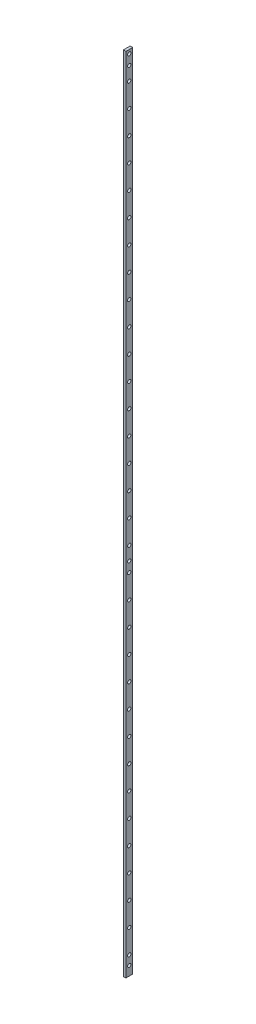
from build123d import *

# Parameters (mm, degrees)
CROQUIS2_W                  = 12.7
CROQUIS2_H                  = 1500
SALIENTE_EXTRUIR2_DEPTH     = 4.8
CROQUIS3_R                  = 3.15
CORTAR_EXTRUIR1_DEPTH       = 1501.061442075
MATRIZL1_COUNT              = 34
MATRIZL1_PITCH              = 44.2
CROQUIS6_R                  = 3.15
SOPORTES_VARILLAS_1_4_DEPTH = 1501.061442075


with BuildPart() as part:
    # Croquis2 → Saliente-Extruir2 (new body)
    with BuildSketch(Plane(origin=(0, 0, 0), x_dir=(0, 0, -1), z_dir=(1, 0, 0))):
        with Locations((6.35, 750)):
            Rectangle(CROQUIS2_W, CROQUIS2_H)
    extrude(amount=SALIENTE_EXTRUIR2_DEPTH)

    # Croquis3 → Cortar-Extruir1 (cut, through all)
    with BuildSketch(Plane(origin=(4.8, 0, 0), x_dir=(0, 0, -1), z_dir=(1, 0, 0))):
        with Locations((6.35, 34.3)):
            Circle(CROQUIS3_R)
    cortar_extruir1 = extrude(amount=-CORTAR_EXTRUIR1_DEPTH, mode=Mode.SUBTRACT)

    # MatrizL1: Cortar-Extruir1 ×34
    with Locations(*[(0, i * MATRIZL1_PITCH, 0) for i in range(1, MATRIZL1_COUNT)]):
        add(cortar_extruir1, mode=Mode.SUBTRACT)

    # Croquis6 → SOPORTES VARILLAS 1-4 (cut, through all)
    with BuildSketch(Plane(origin=(4.8, 0, 0), x_dir=(0, 0, -1), z_dir=(1, 0, 0))):
        with Locations((6.35, 1474)):
            Circle(CROQUIS6_R)
        with Locations((6.35, 17.15)):
            Circle(CROQUIS6_R)
        with Locations((6.35, 672)):
            Circle(CROQUIS6_R)
    extrude(amount=-SOPORTES_VARILLAS_1_4_DEPTH, mode=Mode.SUBTRACT)


solid = part.part
